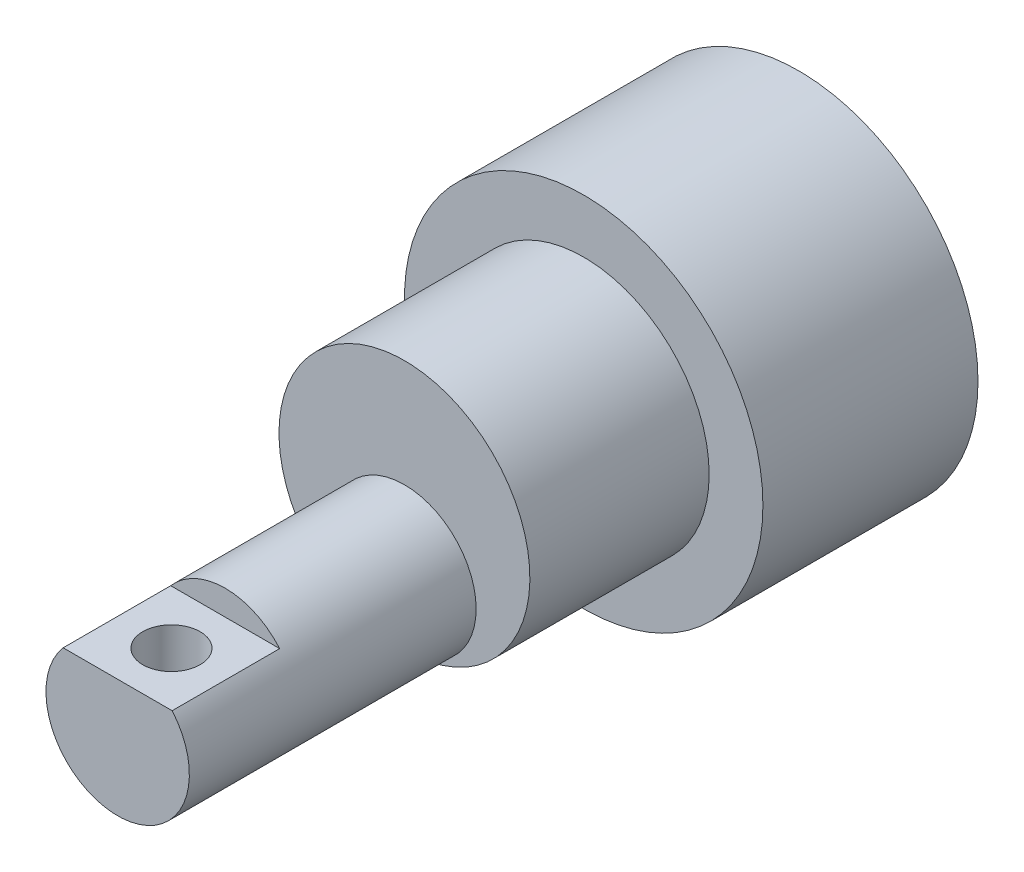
ISO-10303-21;
HEADER;
FILE_DESCRIPTION(('STEP AP214'),'2;1');
FILE_NAME('part.step','',(''),(''),'','','');
FILE_SCHEMA(('AUTOMOTIVE_DESIGN { 1 0 10303 214 1 1 1 1 }'));
ENDSEC;
DATA;
#1=APPLICATION_CONTEXT('core data for automotive mechanical design processes');
#2=APPLICATION_PROTOCOL_DEFINITION('international standard','automotive_design',2000,#1);
#3=PRODUCT_CONTEXT('',#1,'mechanical');
#4=PRODUCT('Part','Part','',(#3));
#5=PRODUCT_RELATED_PRODUCT_CATEGORY('part','',(#4));
#6=PRODUCT_DEFINITION_FORMATION('','',#4);
#7=PRODUCT_DEFINITION_CONTEXT('part definition',#1,'design');
#8=PRODUCT_DEFINITION('design','',#6,#7);
#9=PRODUCT_DEFINITION_SHAPE('','',#8);
#10=(LENGTH_UNIT() NAMED_UNIT(*) SI_UNIT(.MILLI.,.METRE.));
#11=(NAMED_UNIT(*) PLANE_ANGLE_UNIT() SI_UNIT($,.RADIAN.));
#12=(NAMED_UNIT(*) SI_UNIT($,.STERADIAN.) SOLID_ANGLE_UNIT());
#13=UNCERTAINTY_MEASURE_WITH_UNIT(LENGTH_MEASURE(1.E-05),#10,'distance_accuracy_value','');
#14=(GEOMETRIC_REPRESENTATION_CONTEXT(3) GLOBAL_UNCERTAINTY_ASSIGNED_CONTEXT((#13)) GLOBAL_UNIT_ASSIGNED_CONTEXT((#10,
#11,#12)) REPRESENTATION_CONTEXT('',''));
#15=CARTESIAN_POINT('',(0.,0.,0.));
#16=DIRECTION('',(0.,0.,1.));
#17=DIRECTION('',(1.,0.,0.));
#18=AXIS2_PLACEMENT_3D('',#15,#16,#17);
#19=CARTESIAN_POINT('',(0.,0.,60.));
#20=DIRECTION('',(0.,0.,1.));
#21=DIRECTION('',(1.,0.,0.));
#22=AXIS2_PLACEMENT_3D('',#19,#20,#21);
#23=PLANE('',#22);
#24=CARTESIAN_POINT('',(0.,0.,60.));
#25=DIRECTION('',(0.,0.,1.));
#26=DIRECTION('',(1.,0.,0.));
#27=AXIS2_PLACEMENT_3D('',#24,#25,#26);
#28=CIRCLE('',#27,50.);
#29=CARTESIAN_POINT('',(50.,0.,60.));
#30=VERTEX_POINT('',#29);
#31=EDGE_CURVE('E67',#30,#30,#28,.T.);
#32=ORIENTED_EDGE('',*,*,#31,.T.);
#33=EDGE_LOOP('',(#32));
#34=FACE_BOUND('',#33,.T.);
#35=CARTESIAN_POINT('',(0.,0.,60.));
#36=DIRECTION('',(0.,0.,1.));
#37=DIRECTION('',(1.,0.,0.));
#38=AXIS2_PLACEMENT_3D('',#35,#36,#37);
#39=CIRCLE('',#38,35.);
#40=CARTESIAN_POINT('',(35.,0.,60.));
#41=VERTEX_POINT('',#40);
#42=EDGE_CURVE('E75',#41,#41,#39,.T.);
#43=ORIENTED_EDGE('',*,*,#42,.F.);
#44=EDGE_LOOP('',(#43));
#45=FACE_BOUND('',#44,.T.);
#46=ADVANCED_FACE('F31',(#34,#45),#23,.T.);
#47=CARTESIAN_POINT('',(0.,0.,60.));
#48=DIRECTION('',(0.,0.,-1.));
#49=DIRECTION('',(-1.,0.,0.));
#50=AXIS2_PLACEMENT_3D('',#47,#48,#49);
#51=CYLINDRICAL_SURFACE('',#50,50.);
#52=ORIENTED_EDGE('',*,*,#31,.F.);
#53=EDGE_LOOP('',(#52));
#54=FACE_BOUND('',#53,.T.);
#55=CARTESIAN_POINT('',(0.,0.,0.));
#56=DIRECTION('',(0.,0.,1.));
#57=DIRECTION('',(1.,0.,0.));
#58=AXIS2_PLACEMENT_3D('',#55,#56,#57);
#59=CIRCLE('',#58,50.);
#60=CARTESIAN_POINT('',(50.,0.,0.));
#61=VERTEX_POINT('',#60);
#62=EDGE_CURVE('E84',#61,#61,#59,.T.);
#63=ORIENTED_EDGE('',*,*,#62,.T.);
#64=EDGE_LOOP('',(#63));
#65=FACE_BOUND('',#64,.T.);
#66=ADVANCED_FACE('F33',(#54,#65),#51,.T.);
#67=CARTESIAN_POINT('',(0.,0.,0.));
#68=DIRECTION('',(0.,0.,1.));
#69=DIRECTION('',(1.,0.,0.));
#70=AXIS2_PLACEMENT_3D('',#67,#68,#69);
#71=PLANE('',#70);
#72=ORIENTED_EDGE('',*,*,#62,.F.);
#73=EDGE_LOOP('',(#72));
#74=FACE_BOUND('',#73,.T.);
#75=ADVANCED_FACE('F92',(#74),#71,.F.);
#76=CARTESIAN_POINT('',(0.,0.,110.));
#77=DIRECTION('',(0.,0.,-1.));
#78=DIRECTION('',(-1.,0.,0.));
#79=AXIS2_PLACEMENT_3D('',#76,#77,#78);
#80=CYLINDRICAL_SURFACE('',#79,35.);
#81=CARTESIAN_POINT('',(0.,0.,110.));
#82=DIRECTION('',(0.,0.,1.));
#83=DIRECTION('',(1.,0.,0.));
#84=AXIS2_PLACEMENT_3D('',#81,#82,#83);
#85=CIRCLE('',#84,35.);
#86=CARTESIAN_POINT('',(0.,-35.,110.));
#87=VERTEX_POINT('',#86);
#88=EDGE_CURVE('E52',#87,#87,#85,.T.);
#89=ORIENTED_EDGE('',*,*,#88,.F.);
#90=EDGE_LOOP('',(#89));
#91=FACE_BOUND('',#90,.T.);
#92=ORIENTED_EDGE('',*,*,#42,.T.);
#93=EDGE_LOOP('',(#92));
#94=FACE_BOUND('',#93,.T.);
#95=ADVANCED_FACE('F94',(#91,#94),#80,.T.);
#96=CARTESIAN_POINT('',(0.,0.,110.));
#97=DIRECTION('',(0.,0.,1.));
#98=DIRECTION('',(1.,0.,0.));
#99=AXIS2_PLACEMENT_3D('',#96,#97,#98);
#100=PLANE('',#99);
#101=ORIENTED_EDGE('',*,*,#88,.T.);
#102=CARTESIAN_POINT('',(0.,-15.,110.));
#103=DIRECTION('',(0.,0.,1.));
#104=DIRECTION('',(1.,0.,0.));
#105=AXIS2_PLACEMENT_3D('',#102,#103,#104);
#106=CIRCLE('',#105,20.);
#107=EDGE_CURVE('E76',#87,#87,#106,.T.);
#108=ORIENTED_EDGE('',*,*,#107,.F.);
#109=EDGE_LOOP('',(#101,#108));
#110=FACE_BOUND('',#109,.T.);
#111=ADVANCED_FACE('F99',(#110),#100,.T.);
#112=CARTESIAN_POINT('',(0.,-15.,190.));
#113=DIRECTION('',(0.,0.,-1.));
#114=DIRECTION('',(-1.,0.,0.));
#115=AXIS2_PLACEMENT_3D('',#112,#113,#114);
#116=CYLINDRICAL_SURFACE('',#115,20.);
#117=CARTESIAN_POINT('',(0.,-35.,183.));
#118=CARTESIAN_POINT('',(0.215084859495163,-34.9999990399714,182.999998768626));
#119=CARTESIAN_POINT('',(0.430252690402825,-34.9965207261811,182.991314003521));
#120=CARTESIAN_POINT('',(0.859066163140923,-34.9826945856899,182.956653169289));
#121=CARTESIAN_POINT('',(1.07271069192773,-34.9723421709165,182.930665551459));
#122=CARTESIAN_POINT('',(1.49730331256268,-34.9450103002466,182.861580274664));
#123=CARTESIAN_POINT('',(1.70824399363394,-34.928015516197,182.818443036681));
#124=CARTESIAN_POINT('',(2.12541850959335,-34.8878485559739,182.715488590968));
#125=CARTESIAN_POINT('',(2.3316520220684,-34.864675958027,182.655670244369));
#126=CARTESIAN_POINT('',(2.7373286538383,-34.8128420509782,182.520147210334));
#127=CARTESIAN_POINT('',(2.93679233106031,-34.7841995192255,182.444496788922));
#128=CARTESIAN_POINT('',(3.32841850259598,-34.722092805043,182.277837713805));
#129=CARTESIAN_POINT('',(3.5205807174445,-34.6886284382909,182.186828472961));
#130=CARTESIAN_POINT('',(3.89636668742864,-34.6177182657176,181.990226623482));
#131=CARTESIAN_POINT('',(4.0799955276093,-34.5802748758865,181.884642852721));
#132=CARTESIAN_POINT('',(4.43790440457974,-34.5022708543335,181.659558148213));
#133=CARTESIAN_POINT('',(4.61218102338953,-34.4617090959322,181.540052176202));
#134=CARTESIAN_POINT('',(4.95765252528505,-34.3766526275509,181.282520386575));
#135=CARTESIAN_POINT('',(5.12839697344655,-34.3320639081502,181.143921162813));
#136=CARTESIAN_POINT('',(5.45773322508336,-34.2416816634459,180.853322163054));
#137=CARTESIAN_POINT('',(5.616324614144,-34.1958880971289,180.701321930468));
#138=CARTESIAN_POINT('',(5.92057321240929,-34.1042423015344,180.384704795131));
#139=CARTESIAN_POINT('',(6.06622210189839,-34.0583900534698,180.220079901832));
#140=CARTESIAN_POINT('',(6.34357963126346,-33.9678748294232,179.87926764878));
#141=CARTESIAN_POINT('',(6.4752929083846,-33.9232114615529,179.703084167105));
#142=CARTESIAN_POINT('',(6.7296133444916,-33.8343107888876,179.331878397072));
#143=CARTESIAN_POINT('',(6.85154351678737,-33.7901832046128,179.13636506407));
#144=CARTESIAN_POINT('',(7.07835580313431,-33.705921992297,178.73496931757));
#145=CARTESIAN_POINT('',(7.18324492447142,-33.6657867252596,178.529091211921));
#146=CARTESIAN_POINT('',(7.37511081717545,-33.5908137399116,178.108248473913));
#147=CARTESIAN_POINT('',(7.4620902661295,-33.5559752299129,177.893285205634));
#148=CARTESIAN_POINT('',(7.61728962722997,-33.4928075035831,177.455761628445));
#149=CARTESIAN_POINT('',(7.68551081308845,-33.4644778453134,177.233201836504));
#150=CARTESIAN_POINT('',(7.79978805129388,-33.416486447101,176.792419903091));
#151=CARTESIAN_POINT('',(7.84670853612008,-33.3964900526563,176.574458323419));
#152=CARTESIAN_POINT('',(7.92224162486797,-33.3640895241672,176.134824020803));
#153=CARTESIAN_POINT('',(7.95085475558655,-33.3516851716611,175.913151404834));
#154=CARTESIAN_POINT('',(7.98942376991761,-33.3349271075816,175.467978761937));
#155=CARTESIAN_POINT('',(7.99938754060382,-33.3305699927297,175.244479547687));
#156=CARTESIAN_POINT('',(8.00055757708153,-33.3300595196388,174.797427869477));
#157=CARTESIAN_POINT('',(7.99176471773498,-33.3339057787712,174.573875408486));
#158=CARTESIAN_POINT('',(7.95680250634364,-33.3491040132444,174.144155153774));
#159=CARTESIAN_POINT('',(7.93189049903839,-33.3599126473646,173.937864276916));
#160=CARTESIAN_POINT('',(7.86618688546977,-33.3881587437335,173.528215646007));
#161=CARTESIAN_POINT('',(7.82538978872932,-33.4055984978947,173.324858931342));
#162=CARTESIAN_POINT('',(7.72832801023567,-33.4465637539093,172.922560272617));
#163=CARTESIAN_POINT('',(7.67206718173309,-33.4700877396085,172.723617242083));
#164=CARTESIAN_POINT('',(7.54455726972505,-33.5225377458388,172.331249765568));
#165=CARTESIAN_POINT('',(7.4733024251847,-33.5514658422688,172.13782747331));
#166=CARTESIAN_POINT('',(7.31482768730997,-33.6145295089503,171.753881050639));
#167=CARTESIAN_POINT('',(7.22731692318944,-33.648757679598,171.563492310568));
#168=CARTESIAN_POINT('',(7.03795125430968,-33.7210446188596,171.190672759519));
#169=CARTESIAN_POINT('',(6.93609149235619,-33.7591046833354,171.008244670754));
#170=CARTESIAN_POINT('',(6.71872095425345,-33.8380507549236,170.652325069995));
#171=CARTESIAN_POINT('',(6.60320835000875,-33.8789371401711,170.478834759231));
#172=CARTESIAN_POINT('',(6.35923627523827,-33.9625087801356,170.141664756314));
#173=CARTESIAN_POINT('',(6.23077613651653,-34.0051941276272,169.97798557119));
#174=CARTESIAN_POINT('',(5.95116932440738,-34.0946788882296,169.648950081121));
#175=CARTESIAN_POINT('',(5.79903588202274,-34.1415406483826,169.484447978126));
#176=CARTESIAN_POINT('',(5.48150551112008,-34.2348764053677,169.168773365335));
#177=CARTESIAN_POINT('',(5.31611250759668,-34.2813505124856,169.01759693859));
#178=CARTESIAN_POINT('',(4.97286450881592,-34.3727172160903,168.729364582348));
#179=CARTESIAN_POINT('',(4.79500239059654,-34.4176088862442,168.592316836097));
#180=CARTESIAN_POINT('',(4.42799503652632,-34.5045739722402,168.333421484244));
#181=CARTESIAN_POINT('',(4.23885435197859,-34.5466485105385,168.211567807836));
#182=CARTESIAN_POINT('',(3.84640227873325,-34.6276879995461,167.981598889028));
#183=CARTESIAN_POINT('',(3.64288128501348,-34.6665725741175,167.873812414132));
#184=CARTESIAN_POINT('',(3.22662197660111,-34.7391367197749,167.675930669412));
#185=CARTESIAN_POINT('',(3.01388765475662,-34.7728185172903,167.585827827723));
#186=CARTESIAN_POINT('',(2.58066910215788,-34.8340108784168,167.424144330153));
#187=CARTESIAN_POINT('',(2.36018631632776,-34.8615225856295,167.352560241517));
#188=CARTESIAN_POINT('',(1.913130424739,-34.9095569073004,167.228660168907));
#189=CARTESIAN_POINT('',(1.68655774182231,-34.9300800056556,167.176342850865));
#190=CARTESIAN_POINT('',(1.24272594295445,-34.9625193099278,167.094083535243));
#191=CARTESIAN_POINT('',(1.02570985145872,-34.974873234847,167.062999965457));
#192=CARTESIAN_POINT('',(0.589574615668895,-34.9924991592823,167.018744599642));
#193=CARTESIAN_POINT('',(0.370455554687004,-34.9977714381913,167.005572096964));
#194=CARTESIAN_POINT('',(-0.0681278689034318,-35.0010860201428,166.997284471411));
#195=CARTESIAN_POINT('',(-0.287592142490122,-34.9991299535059,167.002165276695));
#196=CARTESIAN_POINT('',(-0.725194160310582,-34.9880462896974,167.02992114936));
#197=CARTESIAN_POINT('',(-0.943331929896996,-34.978918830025,167.052795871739));
#198=CARTESIAN_POINT('',(-1.36679772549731,-34.9543179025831,167.114851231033));
#199=CARTESIAN_POINT('',(-1.57225908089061,-34.9391499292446,167.153248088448));
#200=CARTESIAN_POINT('',(-1.97912323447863,-34.9028842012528,167.245864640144));
#201=CARTESIAN_POINT('',(-2.18052458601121,-34.8817843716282,167.300089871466));
#202=CARTESIAN_POINT('',(-2.57783869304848,-34.834181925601,167.423851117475));
#203=CARTESIAN_POINT('',(-2.7737530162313,-34.8076808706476,167.493382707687));
#204=CARTESIAN_POINT('',(-3.15904550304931,-34.7498961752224,167.647212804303));
#205=CARTESIAN_POINT('',(-3.34842114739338,-34.7186107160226,167.731516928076));
#206=CARTESIAN_POINT('',(-3.72510207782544,-34.6509879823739,167.916991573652));
#207=CARTESIAN_POINT('',(-3.9121720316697,-34.6145266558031,168.018594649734));
#208=CARTESIAN_POINT('',(-4.27717789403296,-34.5381813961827,168.23605894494));
#209=CARTESIAN_POINT('',(-4.45511064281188,-34.4982962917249,168.351925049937));
#210=CARTESIAN_POINT('',(-4.8008662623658,-34.4160569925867,168.597140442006));
#211=CARTESIAN_POINT('',(-4.96868742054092,-34.3737023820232,168.726492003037));
#212=CARTESIAN_POINT('',(-5.29333521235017,-34.2875300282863,168.997886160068));
#213=CARTESIAN_POINT('',(-5.45016136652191,-34.2437122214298,169.139929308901));
#214=CARTESIAN_POINT('',(-5.7620262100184,-34.1527323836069,169.445735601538));
#215=CARTESIAN_POINT('',(-5.91625778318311,-34.1055411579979,169.610314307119));
#216=CARTESIAN_POINT('',(-6.21033668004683,-34.0119837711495,169.951979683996));
#217=CARTESIAN_POINT('',(-6.35018846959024,-33.9656173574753,170.12906244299));
#218=CARTESIAN_POINT('',(-6.61474406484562,-33.8749762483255,170.494876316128));
#219=CARTESIAN_POINT('',(-6.73943916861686,-33.8307027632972,170.683614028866));
#220=CARTESIAN_POINT('',(-6.97264868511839,-33.7456015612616,171.071469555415));
#221=CARTESIAN_POINT('',(-7.08116989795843,-33.7047723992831,171.270582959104));
#222=CARTESIAN_POINT('',(-7.28224510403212,-33.6274162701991,171.680139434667));
#223=CARTESIAN_POINT('',(-7.37462441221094,-33.5909375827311,171.890677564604));
#224=CARTESIAN_POINT('',(-7.54113952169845,-33.5240187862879,172.31967768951));
#225=CARTESIAN_POINT('',(-7.61528359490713,-33.4935759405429,172.5381360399));
#226=CARTESIAN_POINT('',(-7.74457443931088,-33.4398068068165,172.981377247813));
#227=CARTESIAN_POINT('',(-7.79972849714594,-33.4164777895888,173.206157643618));
#228=CARTESIAN_POINT('',(-7.89042733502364,-33.3778017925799,173.660312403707));
#229=CARTESIAN_POINT('',(-7.92597375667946,-33.3624541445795,173.889686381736));
#230=CARTESIAN_POINT('',(-7.97517553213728,-33.3411350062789,174.334439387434));
#231=CARTESIAN_POINT('',(-7.99022284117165,-33.3345679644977,174.549636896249));
#232=CARTESIAN_POINT('',(-8.00288059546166,-33.3290467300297,174.980637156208));
#233=CARTESIAN_POINT('',(-8.00049191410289,-33.3300921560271,175.196439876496));
#234=CARTESIAN_POINT('',(-7.97830753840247,-33.3397587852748,175.626948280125));
#235=CARTESIAN_POINT('',(-7.95851389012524,-33.3483790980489,175.841654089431));
#236=CARTESIAN_POINT('',(-7.90174628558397,-33.3728973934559,176.268357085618));
#237=CARTESIAN_POINT('',(-7.86477240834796,-33.3887953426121,176.480354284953));
#238=CARTESIAN_POINT('',(-7.77585282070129,-33.4265662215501,176.89172445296));
#239=CARTESIAN_POINT('',(-7.72456216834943,-33.4481759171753,177.091263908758));
#240=CARTESIAN_POINT('',(-7.60696222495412,-33.4969774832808,177.485236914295));
#241=CARTESIAN_POINT('',(-7.54064771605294,-33.524171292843,177.679668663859));
#242=CARTESIAN_POINT('',(-7.3935752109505,-33.583361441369,178.062193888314));
#243=CARTESIAN_POINT('',(-7.31281928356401,-33.6153570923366,178.250288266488));
#244=CARTESIAN_POINT('',(-7.13743281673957,-33.6833052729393,178.619225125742));
#245=CARTESIAN_POINT('',(-7.0427972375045,-33.7192592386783,178.800064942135));
#246=CARTESIAN_POINT('',(-6.83452089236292,-33.7963385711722,179.163613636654));
#247=CARTESIAN_POINT('',(-6.72010371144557,-33.8376419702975,179.345840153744));
#248=CARTESIAN_POINT('',(-6.47725116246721,-33.9225198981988,179.700143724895));
#249=CARTESIAN_POINT('',(-6.34881503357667,-33.966094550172,179.872220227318));
#250=CARTESIAN_POINT('',(-6.07864156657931,-34.0544041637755,180.205394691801));
#251=CARTESIAN_POINT('',(-5.93689885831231,-34.0991395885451,180.366488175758));
#252=CARTESIAN_POINT('',(-5.64098897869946,-34.1886197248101,180.676723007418));
#253=CARTESIAN_POINT('',(-5.48682556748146,-34.2333644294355,180.825867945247));
#254=CARTESIAN_POINT('',(-5.15638784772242,-34.3246713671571,181.120771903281));
#255=CARTESIAN_POINT('',(-4.97932704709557,-34.3711614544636,181.265673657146));
#256=CARTESIAN_POINT('',(-4.61309243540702,-34.4616273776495,181.540008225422));
#257=CARTESIAN_POINT('',(-4.42392269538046,-34.5056040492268,181.669446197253));
#258=CARTESIAN_POINT('',(-4.03442016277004,-34.5898744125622,181.912027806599));
#259=CARTESIAN_POINT('',(-3.83407926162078,-34.6301653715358,182.025159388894));
#260=CARTESIAN_POINT('',(-3.42366728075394,-34.7058882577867,182.234052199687));
#261=CARTESIAN_POINT('',(-3.21359701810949,-34.7413205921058,182.329814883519));
#262=CARTESIAN_POINT('',(-2.78913551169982,-34.8057048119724,182.501477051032));
#263=CARTESIAN_POINT('',(-2.57489607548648,-34.8347644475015,182.577711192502));
#264=CARTESIAN_POINT('',(-2.13999204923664,-34.8863864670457,182.711822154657));
#265=CARTESIAN_POINT('',(-1.91932808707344,-34.9089494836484,182.769700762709));
#266=CARTESIAN_POINT('',(-1.47388638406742,-34.9468668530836,182.866350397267));
#267=CARTESIAN_POINT('',(-1.24912144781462,-34.9622406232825,182.905172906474));
#268=CARTESIAN_POINT('',(-0.796824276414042,-34.9854014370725,182.963478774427));
#269=CARTESIAN_POINT('',(-0.569294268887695,-34.9931942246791,182.982976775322));
#270=CARTESIAN_POINT('',(-0.284520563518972,-34.9980572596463,182.995141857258));
#271=CARTESIAN_POINT('',(-0.22763576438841,-34.9987854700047,182.996963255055));
#272=CARTESIAN_POINT('',(-0.113835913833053,-34.9997569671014,182.999392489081));
#273=CARTESIAN_POINT('',(-0.056920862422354,-35.0000002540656,183.000000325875));
#274=CARTESIAN_POINT('',(0.,-35.,183.));
#275=B_SPLINE_CURVE_WITH_KNOTS('',3,(#117,#118,#119,#120,#121,#122,#123,#124,#125,#126,#127,
#128,#129,#130,#131,#132,#133,#134,#135,#136,#137,#138,#139,#140,#141,#142,#143,#144,#145,#146,
#147,#148,#149,#150,#151,#152,#153,#154,#155,#156,#157,#158,#159,#160,#161,#162,#163,#164,#165,
#166,#167,#168,#169,#170,#171,#172,#173,#174,#175,#176,#177,#178,#179,#180,#181,#182,#183,#184,
#185,#186,#187,#188,#189,#190,#191,#192,#193,#194,#195,#196,#197,#198,#199,#200,#201,#202,#203,
#204,#205,#206,#207,#208,#209,#210,#211,#212,#213,#214,#215,#216,#217,#218,#219,#220,#221,#222,
#223,#224,#225,#226,#227,#228,#229,#230,#231,#232,#233,#234,#235,#236,#237,#238,#239,#240,#241,
#242,#243,#244,#245,#246,#247,#248,#249,#250,#251,#252,#253,#254,#255,#256,#257,#258,#259,#260,
#261,#262,#263,#264,#265,#266,#267,#268,#269,#270,#271,#272,#273,#274),.UNSPECIFIED.,.T.,.F.,(4,
2,2,2,2,2,2,2,2,2,2,2,2,2,2,2,2,2,2,2,2,2,2,2,2,2,2,2,2,2,2,2,2,2,2,2,2,2,2,2,2,2,2,2,2,2,2,2,2,
2,2,2,2,2,2,2,2,2,2,2,2,2,2,2,2,2,2,2,2,2,2,2,2,2,2,2,2,2,4),(0.,0.645196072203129,
1.29082320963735,1.93794909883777,2.58511918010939,3.23010632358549,3.87511812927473,
4.51974050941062,5.16459689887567,5.83702768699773,6.50948139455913,7.18236428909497,
7.85502256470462,8.55796624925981,9.26062014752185,9.9631689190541,10.6656699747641,
11.3363324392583,12.00697560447,12.6773350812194,13.3476632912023,13.9711439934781,
14.5948403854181,15.2183815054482,15.842162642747,16.4784228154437,17.1148988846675,
17.7514602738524,18.3880545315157,19.074013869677,19.7597708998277,20.4459229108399,
21.1317998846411,21.8315877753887,22.5310753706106,23.2304332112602,23.9297426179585,
24.5876396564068,25.2455107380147,25.9032334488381,26.5609435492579,27.1889245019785,
27.8171253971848,28.4451449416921,29.0734038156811,29.7206402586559,30.3680990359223,
31.0156671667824,31.6632635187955,32.3537739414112,33.0440692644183,33.734759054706,
34.4251576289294,35.1226183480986,35.8197620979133,36.5166380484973,37.2134556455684,
37.8600994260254,38.5067108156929,39.1532462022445,39.7997786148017,40.4205569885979,
41.0415512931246,41.6624567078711,42.2835881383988,42.9401687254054,43.596784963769,
44.2536673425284,44.9103516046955,45.6099230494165,46.3092605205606,47.0091123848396,
47.7089055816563,48.3957541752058,49.0825358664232,49.7674517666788,50.4518483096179,
50.6225954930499,50.7933425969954),.UNSPECIFIED.);
#276=CARTESIAN_POINT('',(0.,-35.,183.));
#277=VERTEX_POINT('',#276);
#278=EDGE_CURVE('E118',#277,#277,#275,.T.);
#279=ORIENTED_EDGE('',*,*,#278,.T.);
#280=EDGE_LOOP('',(#279));
#281=FACE_BOUND('',#280,.T.);
#282=CARTESIAN_POINT('',(0.,-15.,190.));
#283=DIRECTION('',(0.,0.,1.));
#284=DIRECTION('',(1.,0.,0.));
#285=AXIS2_PLACEMENT_3D('',#282,#283,#284);
#286=CIRCLE('',#285,20.);
#287=CARTESIAN_POINT('',(-15.1986841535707,-2.,190.));
#288=VERTEX_POINT('',#287);
#289=CARTESIAN_POINT('',(15.1986841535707,-2.,190.));
#290=VERTEX_POINT('',#289);
#291=EDGE_CURVE('E71',#288,#290,#286,.T.);
#292=ORIENTED_EDGE('',*,*,#291,.F.);
#293=DIRECTION('',(0.,0.,-1.));
#294=VECTOR('',#293,1.);
#295=CARTESIAN_POINT('',(-15.1986841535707,-2.,190.));
#296=LINE('',#295,#294);
#297=CARTESIAN_POINT('',(-15.1986841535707,-2.,160.));
#298=VERTEX_POINT('',#297);
#299=EDGE_CURVE('E46',#288,#298,#296,.T.);
#300=ORIENTED_EDGE('',*,*,#299,.T.);
#301=CARTESIAN_POINT('',(0.,-15.,160.));
#302=DIRECTION('',(0.,0.,-1.));
#303=DIRECTION('',(-1.,0.,0.));
#304=AXIS2_PLACEMENT_3D('',#301,#302,#303);
#305=CIRCLE('',#304,20.);
#306=CARTESIAN_POINT('',(15.1986841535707,-2.,160.));
#307=VERTEX_POINT('',#306);
#308=EDGE_CURVE('E11',#298,#307,#305,.T.);
#309=ORIENTED_EDGE('',*,*,#308,.T.);
#310=DIRECTION('',(0.,0.,-1.));
#311=VECTOR('',#310,1.);
#312=CARTESIAN_POINT('',(15.1986841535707,-2.,190.));
#313=LINE('',#312,#311);
#314=EDGE_CURVE('E62',#307,#290,#313,.F.);
#315=ORIENTED_EDGE('',*,*,#314,.T.);
#316=EDGE_LOOP('',(#292,#300,#309,#315));
#317=FACE_BOUND('',#316,.T.);
#318=ORIENTED_EDGE('',*,*,#107,.T.);
#319=EDGE_LOOP('',(#318));
#320=FACE_BOUND('',#319,.T.);
#321=ADVANCED_FACE('F69',(#281,#317,#320),#116,.T.);
#322=CARTESIAN_POINT('',(0.,-15.,190.));
#323=DIRECTION('',(0.,0.,1.));
#324=DIRECTION('',(1.,0.,0.));
#325=AXIS2_PLACEMENT_3D('',#322,#323,#324);
#326=PLANE('',#325);
#327=DIRECTION('',(1.,0.,0.));
#328=VECTOR('',#327,1.);
#329=CARTESIAN_POINT('',(0.,-2.,190.));
#330=LINE('',#329,#328);
#331=EDGE_CURVE('E39',#288,#290,#330,.T.);
#332=ORIENTED_EDGE('',*,*,#331,.F.);
#333=ORIENTED_EDGE('',*,*,#291,.T.);
#334=EDGE_LOOP('',(#332,#333));
#335=FACE_BOUND('',#334,.T.);
#336=ADVANCED_FACE('F74',(#335),#326,.T.);
#337=CARTESIAN_POINT('',(-20.,-2.,160.));
#338=DIRECTION('',(0.,0.,-1.));
#339=DIRECTION('',(-1.,0.,0.));
#340=AXIS2_PLACEMENT_3D('',#337,#338,#339);
#341=PLANE('',#340);
#342=DIRECTION('',(-1.,0.,0.));
#343=VECTOR('',#342,1.);
#344=CARTESIAN_POINT('',(-20.,-2.,160.));
#345=LINE('',#344,#343);
#346=EDGE_CURVE('E72',#307,#298,#345,.T.);
#347=ORIENTED_EDGE('',*,*,#346,.F.);
#348=ORIENTED_EDGE('',*,*,#308,.F.);
#349=EDGE_LOOP('',(#347,#348));
#350=FACE_BOUND('',#349,.T.);
#351=ADVANCED_FACE('F132',(#350),#341,.F.);
#352=CARTESIAN_POINT('',(-20.,-2.,190.));
#353=DIRECTION('',(0.,-1.,0.));
#354=DIRECTION('',(0.,0.,-1.));
#355=AXIS2_PLACEMENT_3D('',#352,#353,#354);
#356=PLANE('',#355);
#357=CARTESIAN_POINT('',(0.,-2.,175.));
#358=DIRECTION('',(0.,1.,0.));
#359=DIRECTION('',(0.,0.,1.));
#360=AXIS2_PLACEMENT_3D('',#357,#358,#359);
#361=CIRCLE('',#360,8.);
#362=CARTESIAN_POINT('',(0.,-2.,183.));
#363=VERTEX_POINT('',#362);
#364=EDGE_CURVE('E125',#363,#363,#361,.T.);
#365=ORIENTED_EDGE('',*,*,#364,.F.);
#366=EDGE_LOOP('',(#365));
#367=FACE_BOUND('',#366,.T.);
#368=ORIENTED_EDGE('',*,*,#331,.T.);
#369=ORIENTED_EDGE('',*,*,#314,.F.);
#370=ORIENTED_EDGE('',*,*,#346,.T.);
#371=ORIENTED_EDGE('',*,*,#299,.F.);
#372=EDGE_LOOP('',(#368,#369,#370,#371));
#373=FACE_BOUND('',#372,.T.);
#374=ADVANCED_FACE('F61',(#367,#373),#356,.F.);
#375=CARTESIAN_POINT('',(0.,-50.,175.));
#376=DIRECTION('',(0.,1.,0.));
#377=DIRECTION('',(0.,0.,1.));
#378=AXIS2_PLACEMENT_3D('',#375,#376,#377);
#379=CYLINDRICAL_SURFACE('',#378,8.);
#380=ORIENTED_EDGE('',*,*,#364,.T.);
#381=EDGE_LOOP('',(#380));
#382=FACE_BOUND('',#381,.T.);
#383=ORIENTED_EDGE('',*,*,#278,.F.);
#384=EDGE_LOOP('',(#383));
#385=FACE_BOUND('',#384,.T.);
#386=ADVANCED_FACE('F126',(#382,#385),#379,.F.);
#387=CLOSED_SHELL('',(#46,#66,#75,#95,#111,#321,#336,#351,#374,#386));
#388=MANIFOLD_SOLID_BREP('B2',#387);
#389=ADVANCED_BREP_SHAPE_REPRESENTATION('',(#18,#388),#14);
#390=SHAPE_DEFINITION_REPRESENTATION(#9,#389);
ENDSEC;
END-ISO-10303-21;
